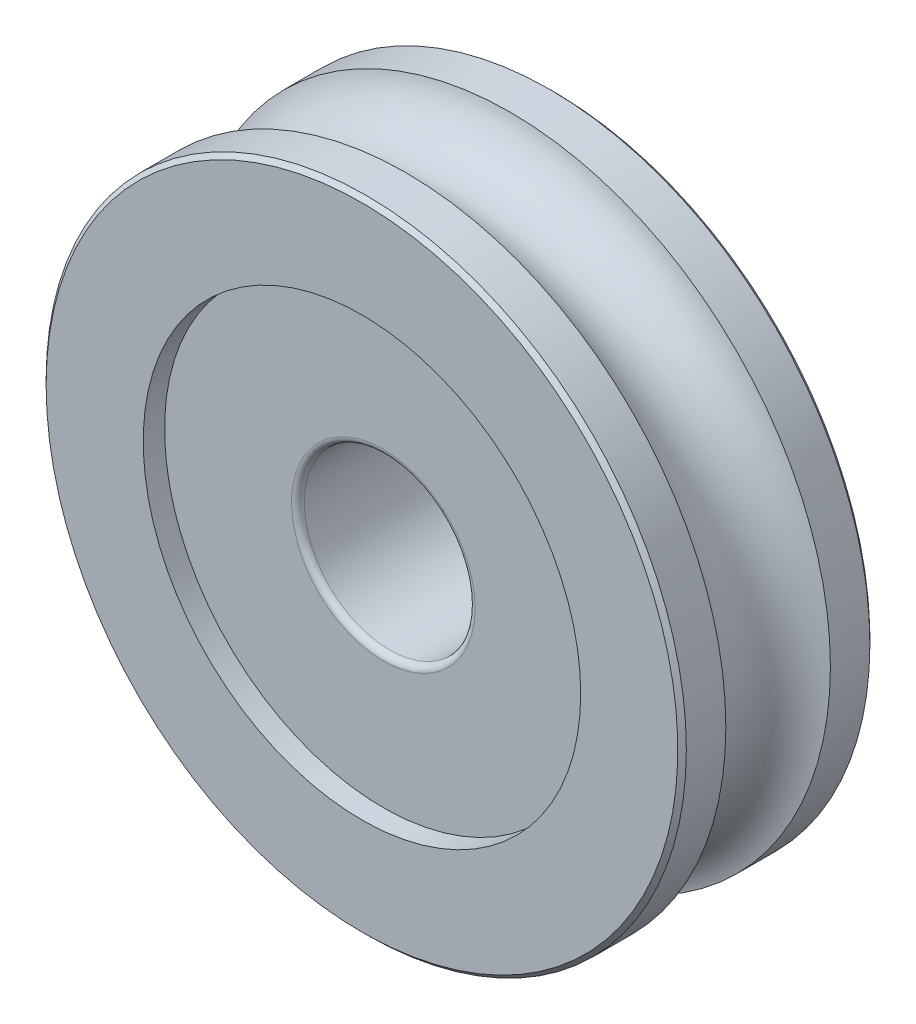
ISO-10303-21;
HEADER;
FILE_DESCRIPTION(('STEP AP214'),'2;1');
FILE_NAME('part.step','',(''),(''),'','','');
FILE_SCHEMA(('AUTOMOTIVE_DESIGN { 1 0 10303 214 1 1 1 1 }'));
ENDSEC;
DATA;
#1=APPLICATION_CONTEXT('core data for automotive mechanical design processes');
#2=APPLICATION_PROTOCOL_DEFINITION('international standard','automotive_design',2000,#1);
#3=PRODUCT_CONTEXT('',#1,'mechanical');
#4=PRODUCT('Part','Part','',(#3));
#5=PRODUCT_RELATED_PRODUCT_CATEGORY('part','',(#4));
#6=PRODUCT_DEFINITION_FORMATION('','',#4);
#7=PRODUCT_DEFINITION_CONTEXT('part definition',#1,'design');
#8=PRODUCT_DEFINITION('design','',#6,#7);
#9=PRODUCT_DEFINITION_SHAPE('','',#8);
#10=(LENGTH_UNIT() NAMED_UNIT(*) SI_UNIT(.MILLI.,.METRE.));
#11=(NAMED_UNIT(*) PLANE_ANGLE_UNIT() SI_UNIT($,.RADIAN.));
#12=(NAMED_UNIT(*) SI_UNIT($,.STERADIAN.) SOLID_ANGLE_UNIT());
#13=UNCERTAINTY_MEASURE_WITH_UNIT(LENGTH_MEASURE(1.E-05),#10,'distance_accuracy_value','');
#14=(GEOMETRIC_REPRESENTATION_CONTEXT(3) GLOBAL_UNCERTAINTY_ASSIGNED_CONTEXT((#13)) GLOBAL_UNIT_ASSIGNED_CONTEXT((#10,
#11,#12)) REPRESENTATION_CONTEXT('',''));
#15=CARTESIAN_POINT('',(0.,0.,0.));
#16=DIRECTION('',(0.,0.,1.));
#17=DIRECTION('',(1.,0.,0.));
#18=AXIS2_PLACEMENT_3D('',#15,#16,#17);
#19=CARTESIAN_POINT('',(0.,12.179449,-4.5));
#20=DIRECTION('',(0.,0.,1.));
#21=DIRECTION('',(1.,0.,0.));
#22=AXIS2_PLACEMENT_3D('',#19,#20,#21);
#23=PLANE('',#22);
#24=CARTESIAN_POINT('',(0.,0.,-4.5));
#25=DIRECTION('',(0.,0.,-1.));
#26=DIRECTION('',(-1.,0.,0.));
#27=AXIS2_PLACEMENT_3D('',#24,#25,#26);
#28=CIRCLE('',#27,14.8);
#29=CARTESIAN_POINT('',(-14.8,0.,-4.5));
#30=VERTEX_POINT('',#29);
#31=EDGE_CURVE('E44',#30,#30,#28,.T.);
#32=ORIENTED_EDGE('',*,*,#31,.T.);
#33=EDGE_LOOP('',(#32));
#34=FACE_BOUND('',#33,.T.);
#35=CARTESIAN_POINT('',(0.,0.,-4.5));
#36=DIRECTION('',(0.,0.,1.));
#37=DIRECTION('',(1.,0.,0.));
#38=AXIS2_PLACEMENT_3D('',#35,#36,#37);
#39=CIRCLE('',#38,10.25);
#40=CARTESIAN_POINT('',(10.25,0.,-4.5));
#41=VERTEX_POINT('',#40);
#42=EDGE_CURVE('E32',#41,#41,#39,.T.);
#43=ORIENTED_EDGE('',*,*,#42,.T.);
#44=EDGE_LOOP('',(#43));
#45=FACE_BOUND('',#44,.T.);
#46=ADVANCED_FACE('F12',(#34,#45),#23,.F.);
#47=CARTESIAN_POINT('',(0.,12.179449,4.5));
#48=DIRECTION('',(0.,0.,-1.));
#49=DIRECTION('',(-1.,0.,0.));
#50=AXIS2_PLACEMENT_3D('',#47,#48,#49);
#51=PLANE('',#50);
#52=CARTESIAN_POINT('',(0.,0.,4.5));
#53=DIRECTION('',(0.,0.,-1.));
#54=DIRECTION('',(-1.,0.,0.));
#55=AXIS2_PLACEMENT_3D('',#52,#53,#54);
#56=CIRCLE('',#55,14.8);
#57=CARTESIAN_POINT('',(-14.8,0.,4.5));
#58=VERTEX_POINT('',#57);
#59=EDGE_CURVE('E59',#58,#58,#56,.T.);
#60=ORIENTED_EDGE('',*,*,#59,.F.);
#61=EDGE_LOOP('',(#60));
#62=FACE_BOUND('',#61,.T.);
#63=CARTESIAN_POINT('',(0.,0.,4.5));
#64=DIRECTION('',(0.,0.,1.));
#65=DIRECTION('',(1.,0.,0.));
#66=AXIS2_PLACEMENT_3D('',#63,#64,#65);
#67=CIRCLE('',#66,10.25);
#68=CARTESIAN_POINT('',(10.25,0.,4.5));
#69=VERTEX_POINT('',#68);
#70=EDGE_CURVE('E35',#69,#69,#67,.T.);
#71=ORIENTED_EDGE('',*,*,#70,.F.);
#72=EDGE_LOOP('',(#71));
#73=FACE_BOUND('',#72,.T.);
#74=ADVANCED_FACE('F66',(#62,#73),#51,.F.);
#75=CARTESIAN_POINT('',(0.,0.,3.2));
#76=DIRECTION('',(0.,0.,1.));
#77=DIRECTION('',(1.,0.,0.));
#78=AXIS2_PLACEMENT_3D('',#75,#76,#77);
#79=TOROIDAL_SURFACE('',#78,4.3,0.3);
#80=CARTESIAN_POINT('',(0.,0.,3.2));
#81=DIRECTION('',(0.,0.,1.));
#82=DIRECTION('',(1.,0.,0.));
#83=AXIS2_PLACEMENT_3D('',#80,#81,#82);
#84=CIRCLE('',#83,4.);
#85=CARTESIAN_POINT('',(4.,0.,3.2));
#86=VERTEX_POINT('',#85);
#87=EDGE_CURVE('E8',#86,#86,#84,.T.);
#88=ORIENTED_EDGE('',*,*,#87,.F.);
#89=EDGE_LOOP('',(#88));
#90=FACE_BOUND('',#89,.T.);
#91=CARTESIAN_POINT('',(0.,0.,3.5));
#92=DIRECTION('',(0.,0.,1.));
#93=DIRECTION('',(1.,0.,0.));
#94=AXIS2_PLACEMENT_3D('',#91,#92,#93);
#95=CIRCLE('',#94,4.3);
#96=CARTESIAN_POINT('',(4.3,0.,3.5));
#97=VERTEX_POINT('',#96);
#98=EDGE_CURVE('E41',#97,#97,#95,.T.);
#99=ORIENTED_EDGE('',*,*,#98,.T.);
#100=EDGE_LOOP('',(#99));
#101=FACE_BOUND('',#100,.T.);
#102=ADVANCED_FACE('F14',(#90,#101),#79,.T.);
#103=CARTESIAN_POINT('',(0.,0.,7.5));
#104=DIRECTION('',(0.,0.,1.));
#105=DIRECTION('',(1.,0.,0.));
#106=AXIS2_PLACEMENT_3D('',#103,#104,#105);
#107=CYLINDRICAL_SURFACE('',#106,4.);
#108=CARTESIAN_POINT('',(0.,0.,-3.2));
#109=DIRECTION('',(0.,0.,1.));
#110=DIRECTION('',(1.,0.,0.));
#111=AXIS2_PLACEMENT_3D('',#108,#109,#110);
#112=CIRCLE('',#111,4.);
#113=CARTESIAN_POINT('',(4.,0.,-3.2));
#114=VERTEX_POINT('',#113);
#115=EDGE_CURVE('E19',#114,#114,#112,.T.);
#116=ORIENTED_EDGE('',*,*,#115,.F.);
#117=EDGE_LOOP('',(#116));
#118=FACE_BOUND('',#117,.T.);
#119=ORIENTED_EDGE('',*,*,#87,.T.);
#120=EDGE_LOOP('',(#119));
#121=FACE_BOUND('',#120,.T.);
#122=ADVANCED_FACE('F102',(#118,#121),#107,.F.);
#123=CARTESIAN_POINT('',(0.,0.,-3.2));
#124=DIRECTION('',(0.,0.,1.));
#125=DIRECTION('',(1.,0.,0.));
#126=AXIS2_PLACEMENT_3D('',#123,#124,#125);
#127=TOROIDAL_SURFACE('',#126,4.3,0.299999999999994);
#128=CARTESIAN_POINT('',(0.,0.,-3.5));
#129=DIRECTION('',(0.,0.,1.));
#130=DIRECTION('',(1.,0.,0.));
#131=AXIS2_PLACEMENT_3D('',#128,#129,#130);
#132=CIRCLE('',#131,4.3);
#133=CARTESIAN_POINT('',(4.3,0.,-3.5));
#134=VERTEX_POINT('',#133);
#135=EDGE_CURVE('E23',#134,#134,#132,.T.);
#136=ORIENTED_EDGE('',*,*,#135,.F.);
#137=EDGE_LOOP('',(#136));
#138=FACE_BOUND('',#137,.T.);
#139=ORIENTED_EDGE('',*,*,#115,.T.);
#140=EDGE_LOOP('',(#139));
#141=FACE_BOUND('',#140,.T.);
#142=ADVANCED_FACE('F99',(#138,#141),#127,.T.);
#143=CARTESIAN_POINT('',(0.,4.3,-3.5));
#144=DIRECTION('',(0.,0.,1.));
#145=DIRECTION('',(1.,0.,0.));
#146=AXIS2_PLACEMENT_3D('',#143,#144,#145);
#147=PLANE('',#146);
#148=CARTESIAN_POINT('',(0.,0.,-3.5));
#149=DIRECTION('',(0.,0.,1.));
#150=DIRECTION('',(1.,0.,0.));
#151=AXIS2_PLACEMENT_3D('',#148,#149,#150);
#152=CIRCLE('',#151,10.25);
#153=CARTESIAN_POINT('',(10.25,0.,-3.5));
#154=VERTEX_POINT('',#153);
#155=EDGE_CURVE('E27',#154,#154,#152,.T.);
#156=ORIENTED_EDGE('',*,*,#155,.F.);
#157=EDGE_LOOP('',(#156));
#158=FACE_BOUND('',#157,.T.);
#159=ORIENTED_EDGE('',*,*,#135,.T.);
#160=EDGE_LOOP('',(#159));
#161=FACE_BOUND('',#160,.T.);
#162=ADVANCED_FACE('F86',(#158,#161),#147,.F.);
#163=CARTESIAN_POINT('',(0.,0.,7.5));
#164=DIRECTION('',(0.,0.,1.));
#165=DIRECTION('',(1.,0.,0.));
#166=AXIS2_PLACEMENT_3D('',#163,#164,#165);
#167=CYLINDRICAL_SURFACE('',#166,10.25);
#168=ORIENTED_EDGE('',*,*,#42,.F.);
#169=EDGE_LOOP('',(#168));
#170=FACE_BOUND('',#169,.T.);
#171=ORIENTED_EDGE('',*,*,#155,.T.);
#172=EDGE_LOOP('',(#171));
#173=FACE_BOUND('',#172,.T.);
#174=ADVANCED_FACE('F75',(#170,#173),#167,.F.);
#175=CARTESIAN_POINT('',(0.,0.,7.5));
#176=DIRECTION('',(0.,0.,1.));
#177=DIRECTION('',(1.,0.,0.));
#178=AXIS2_PLACEMENT_3D('',#175,#176,#177);
#179=CYLINDRICAL_SURFACE('',#178,10.25);
#180=CARTESIAN_POINT('',(0.,0.,3.5));
#181=DIRECTION('',(0.,0.,1.));
#182=DIRECTION('',(1.,0.,0.));
#183=AXIS2_PLACEMENT_3D('',#180,#181,#182);
#184=CIRCLE('',#183,10.25);
#185=CARTESIAN_POINT('',(10.25,0.,3.5));
#186=VERTEX_POINT('',#185);
#187=EDGE_CURVE('E38',#186,#186,#184,.T.);
#188=ORIENTED_EDGE('',*,*,#187,.F.);
#189=EDGE_LOOP('',(#188));
#190=FACE_BOUND('',#189,.T.);
#191=ORIENTED_EDGE('',*,*,#70,.T.);
#192=EDGE_LOOP('',(#191));
#193=FACE_BOUND('',#192,.T.);
#194=ADVANCED_FACE('F72',(#190,#193),#179,.F.);
#195=CARTESIAN_POINT('',(0.,10.25,3.5));
#196=DIRECTION('',(0.,0.,-1.));
#197=DIRECTION('',(-1.,0.,0.));
#198=AXIS2_PLACEMENT_3D('',#195,#196,#197);
#199=PLANE('',#198);
#200=ORIENTED_EDGE('',*,*,#98,.F.);
#201=EDGE_LOOP('',(#200));
#202=FACE_BOUND('',#201,.T.);
#203=ORIENTED_EDGE('',*,*,#187,.T.);
#204=EDGE_LOOP('',(#203));
#205=FACE_BOUND('',#204,.T.);
#206=ADVANCED_FACE('F74',(#202,#205),#199,.F.);
#207=CARTESIAN_POINT('',(0.,0.,-4.5));
#208=DIRECTION('',(0.,0.,1.));
#209=DIRECTION('',(1.,0.,0.));
#210=AXIS2_PLACEMENT_3D('',#207,#208,#209);
#211=CONICAL_SURFACE('',#210,14.8,0.785398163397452);
#212=CARTESIAN_POINT('',(0.,0.,-4.3));
#213=DIRECTION('',(0.,0.,-1.));
#214=DIRECTION('',(-1.,0.,0.));
#215=AXIS2_PLACEMENT_3D('',#212,#213,#214);
#216=CIRCLE('',#215,15.);
#217=CARTESIAN_POINT('',(-15.,0.,-4.3));
#218=VERTEX_POINT('',#217);
#219=EDGE_CURVE('E47',#218,#218,#216,.T.);
#220=ORIENTED_EDGE('',*,*,#219,.T.);
#221=EDGE_LOOP('',(#220));
#222=FACE_BOUND('',#221,.T.);
#223=ORIENTED_EDGE('',*,*,#31,.F.);
#224=EDGE_LOOP('',(#223));
#225=FACE_BOUND('',#224,.T.);
#226=ADVANCED_FACE('F83',(#222,#225),#211,.T.);
#227=CARTESIAN_POINT('',(0.,0.,0.766812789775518));
#228=DIRECTION('',(0.,0.,-1.));
#229=DIRECTION('',(-1.,0.,0.));
#230=AXIS2_PLACEMENT_3D('',#227,#228,#229);
#231=CYLINDRICAL_SURFACE('',#230,15.);
#232=CARTESIAN_POINT('',(0.,0.,-2.44948974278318));
#233=DIRECTION('',(0.,0.,-1.));
#234=DIRECTION('',(-1.,0.,0.));
#235=AXIS2_PLACEMENT_3D('',#232,#233,#234);
#236=CIRCLE('',#235,15.);
#237=CARTESIAN_POINT('',(-15.,0.,-2.44948974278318));
#238=VERTEX_POINT('',#237);
#239=EDGE_CURVE('E50',#238,#238,#236,.T.);
#240=ORIENTED_EDGE('',*,*,#239,.T.);
#241=EDGE_LOOP('',(#240));
#242=FACE_BOUND('',#241,.T.);
#243=ORIENTED_EDGE('',*,*,#219,.F.);
#244=EDGE_LOOP('',(#243));
#245=FACE_BOUND('',#244,.T.);
#246=ADVANCED_FACE('F160',(#242,#245),#231,.T.);
#247=CARTESIAN_POINT('',(0.,0.,0.));
#248=DIRECTION('',(0.,0.,-1.));
#249=DIRECTION('',(-1.,0.,0.));
#250=AXIS2_PLACEMENT_3D('',#247,#248,#249);
#251=TOROIDAL_SURFACE('',#250,15.5,2.5);
#252=CARTESIAN_POINT('',(0.,0.,2.44948974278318));
#253=DIRECTION('',(0.,0.,-1.));
#254=DIRECTION('',(-1.,0.,0.));
#255=AXIS2_PLACEMENT_3D('',#252,#253,#254);
#256=CIRCLE('',#255,15.);
#257=CARTESIAN_POINT('',(-15.,0.,2.44948974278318));
#258=VERTEX_POINT('',#257);
#259=EDGE_CURVE('E53',#258,#258,#256,.T.);
#260=ORIENTED_EDGE('',*,*,#259,.T.);
#261=EDGE_LOOP('',(#260));
#262=FACE_BOUND('',#261,.T.);
#263=ORIENTED_EDGE('',*,*,#239,.F.);
#264=EDGE_LOOP('',(#263));
#265=FACE_BOUND('',#264,.T.);
#266=ADVANCED_FACE('F170',(#262,#265),#251,.F.);
#267=CARTESIAN_POINT('',(0.,0.,0.766812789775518));
#268=DIRECTION('',(0.,0.,-1.));
#269=DIRECTION('',(-1.,0.,0.));
#270=AXIS2_PLACEMENT_3D('',#267,#268,#269);
#271=CYLINDRICAL_SURFACE('',#270,15.);
#272=CARTESIAN_POINT('',(0.,0.,4.3));
#273=DIRECTION('',(0.,0.,-1.));
#274=DIRECTION('',(-1.,0.,0.));
#275=AXIS2_PLACEMENT_3D('',#272,#273,#274);
#276=CIRCLE('',#275,15.);
#277=CARTESIAN_POINT('',(-15.,0.,4.3));
#278=VERTEX_POINT('',#277);
#279=EDGE_CURVE('E56',#278,#278,#276,.T.);
#280=ORIENTED_EDGE('',*,*,#279,.T.);
#281=EDGE_LOOP('',(#280));
#282=FACE_BOUND('',#281,.T.);
#283=ORIENTED_EDGE('',*,*,#259,.F.);
#284=EDGE_LOOP('',(#283));
#285=FACE_BOUND('',#284,.T.);
#286=ADVANCED_FACE('F179',(#282,#285),#271,.T.);
#287=CARTESIAN_POINT('',(0.,0.,4.3));
#288=DIRECTION('',(0.,0.,-1.));
#289=DIRECTION('',(-1.,0.,0.));
#290=AXIS2_PLACEMENT_3D('',#287,#288,#289);
#291=CONICAL_SURFACE('',#290,15.,0.78539816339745);
#292=ORIENTED_EDGE('',*,*,#59,.T.);
#293=EDGE_LOOP('',(#292));
#294=FACE_BOUND('',#293,.T.);
#295=ORIENTED_EDGE('',*,*,#279,.F.);
#296=EDGE_LOOP('',(#295));
#297=FACE_BOUND('',#296,.T.);
#298=ADVANCED_FACE('F63',(#294,#297),#291,.T.);
#299=CLOSED_SHELL('',(#46,#74,#102,#122,#142,#162,#174,#194,#206,#226,#246,#266,#286,#298));
#300=MANIFOLD_SOLID_BREP('B1',#299);
#301=ADVANCED_BREP_SHAPE_REPRESENTATION('',(#18,#300),#14);
#302=SHAPE_DEFINITION_REPRESENTATION(#9,#301);
ENDSEC;
END-ISO-10303-21;
